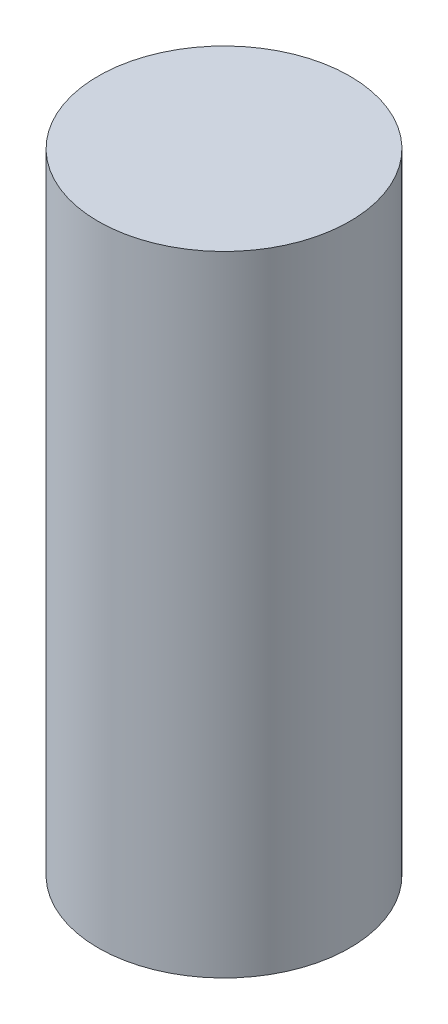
ISO-10303-21;
HEADER;
FILE_DESCRIPTION(('STEP AP214'),'2;1');
FILE_NAME('part.step','',(''),(''),'','','');
FILE_SCHEMA(('AUTOMOTIVE_DESIGN { 1 0 10303 214 1 1 1 1 }'));
ENDSEC;
DATA;
#1=APPLICATION_CONTEXT('core data for automotive mechanical design processes');
#2=APPLICATION_PROTOCOL_DEFINITION('international standard','automotive_design',2000,#1);
#3=PRODUCT_CONTEXT('',#1,'mechanical');
#4=PRODUCT('Part','Part','',(#3));
#5=PRODUCT_RELATED_PRODUCT_CATEGORY('part','',(#4));
#6=PRODUCT_DEFINITION_FORMATION('','',#4);
#7=PRODUCT_DEFINITION_CONTEXT('part definition',#1,'design');
#8=PRODUCT_DEFINITION('design','',#6,#7);
#9=PRODUCT_DEFINITION_SHAPE('','',#8);
#10=(LENGTH_UNIT() NAMED_UNIT(*) SI_UNIT(.MILLI.,.METRE.));
#11=(NAMED_UNIT(*) PLANE_ANGLE_UNIT() SI_UNIT($,.RADIAN.));
#12=(NAMED_UNIT(*) SI_UNIT($,.STERADIAN.) SOLID_ANGLE_UNIT());
#13=UNCERTAINTY_MEASURE_WITH_UNIT(LENGTH_MEASURE(1.E-05),#10,'distance_accuracy_value','');
#14=(GEOMETRIC_REPRESENTATION_CONTEXT(3) GLOBAL_UNCERTAINTY_ASSIGNED_CONTEXT((#13)) GLOBAL_UNIT_ASSIGNED_CONTEXT((#10,
#11,#12)) REPRESENTATION_CONTEXT('',''));
#15=CARTESIAN_POINT('',(0.,0.,0.));
#16=DIRECTION('',(0.,0.,1.));
#17=DIRECTION('',(1.,0.,0.));
#18=AXIS2_PLACEMENT_3D('',#15,#16,#17);
#19=CARTESIAN_POINT('',(0.,82.55,0.));
#20=DIRECTION('',(0.,-1.,0.));
#21=DIRECTION('',(0.,0.,-1.));
#22=AXIS2_PLACEMENT_3D('',#19,#20,#21);
#23=CYLINDRICAL_SURFACE('',#22,33.02);
#24=CARTESIAN_POINT('',(0.,82.55,0.));
#25=DIRECTION('',(0.,1.,0.));
#26=DIRECTION('',(0.,0.,1.));
#27=AXIS2_PLACEMENT_3D('',#24,#25,#26);
#28=CIRCLE('',#27,33.02);
#29=CARTESIAN_POINT('',(0.,82.55,33.02));
#30=VERTEX_POINT('',#29);
#31=EDGE_CURVE('E10',#30,#30,#28,.T.);
#32=ORIENTED_EDGE('',*,*,#31,.F.);
#33=EDGE_LOOP('',(#32));
#34=FACE_BOUND('',#33,.T.);
#35=CARTESIAN_POINT('',(0.,-82.55,0.));
#36=DIRECTION('',(0.,1.,0.));
#37=DIRECTION('',(0.,0.,1.));
#38=AXIS2_PLACEMENT_3D('',#35,#36,#37);
#39=CIRCLE('',#38,33.02);
#40=CARTESIAN_POINT('',(0.,-82.55,33.02));
#41=VERTEX_POINT('',#40);
#42=EDGE_CURVE('E32',#41,#41,#39,.T.);
#43=ORIENTED_EDGE('',*,*,#42,.T.);
#44=EDGE_LOOP('',(#43));
#45=FACE_BOUND('',#44,.T.);
#46=ADVANCED_FACE('F26',(#34,#45),#23,.T.);
#47=CARTESIAN_POINT('',(0.,82.55,0.));
#48=DIRECTION('',(0.,1.,0.));
#49=DIRECTION('',(0.,0.,1.));
#50=AXIS2_PLACEMENT_3D('',#47,#48,#49);
#51=PLANE('',#50);
#52=ORIENTED_EDGE('',*,*,#31,.T.);
#53=EDGE_LOOP('',(#52));
#54=FACE_BOUND('',#53,.T.);
#55=ADVANCED_FACE('F41',(#54),#51,.T.);
#56=CARTESIAN_POINT('',(0.,-82.55,0.));
#57=DIRECTION('',(0.,1.,0.));
#58=DIRECTION('',(0.,0.,1.));
#59=AXIS2_PLACEMENT_3D('',#56,#57,#58);
#60=PLANE('',#59);
#61=ORIENTED_EDGE('',*,*,#42,.F.);
#62=EDGE_LOOP('',(#61));
#63=FACE_BOUND('',#62,.T.);
#64=ADVANCED_FACE('F39',(#63),#60,.F.);
#65=CLOSED_SHELL('',(#46,#55,#64));
#66=MANIFOLD_SOLID_BREP('B2',#65);
#67=ADVANCED_BREP_SHAPE_REPRESENTATION('',(#18,#66),#14);
#68=SHAPE_DEFINITION_REPRESENTATION(#9,#67);
ENDSEC;
END-ISO-10303-21;
